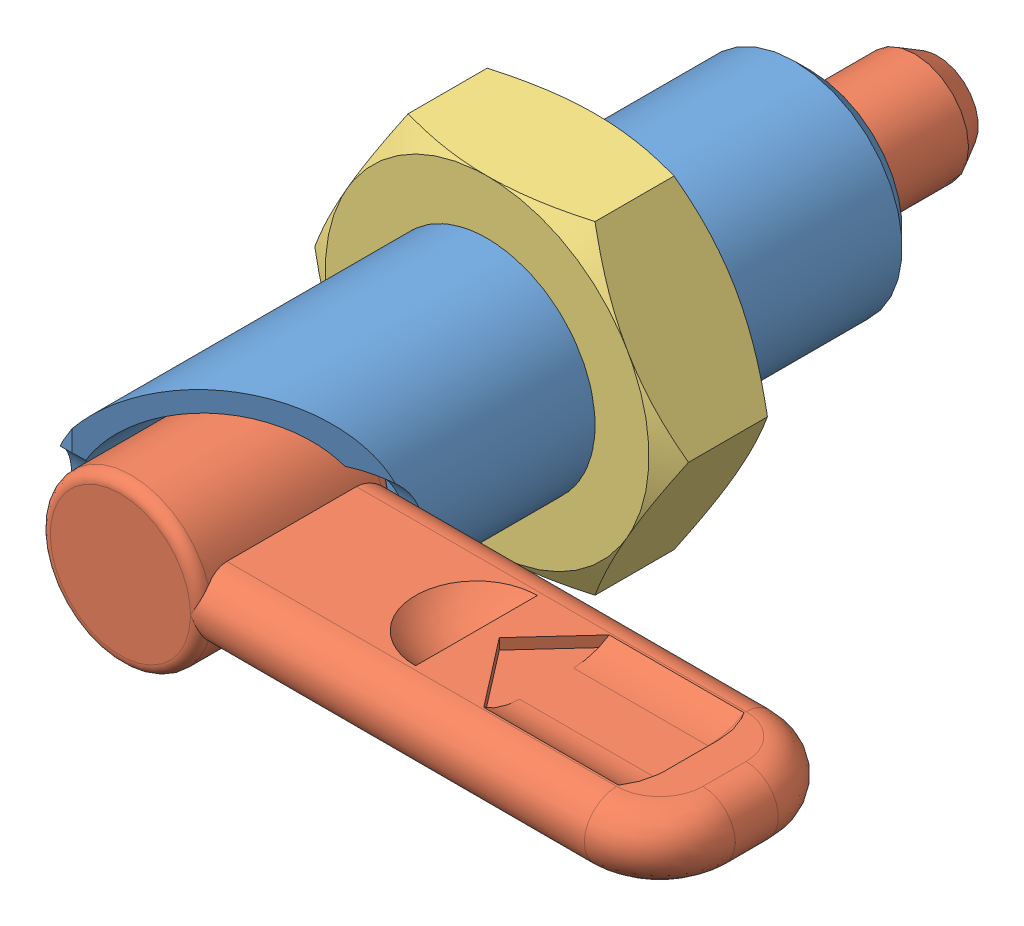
SolidWorks assembly GDX16LW-8N.sldasm, configuration Default (file format 15000). Lengths in mm.
Overall size (56.4 32.79 61.21).
3 component instances, 3 part files, 0 mates.
Components (placement in the parent):
- GDX16LW-8N_01-1: GDX16LW-8N_01.SLDPRT [ﾃﾞﾌｫﾙﾄ] x (1 0 0) z (0 -1 0) size (16.02 50.53 16.01)
- GDX16LW-8N_02-1: GDX16LW-8N_02.SLDPRT [ﾃﾞﾌｫﾙﾄ] x (1 0 0) z (0 -1 0) size (46 61.21 12)
- GDX16LW-8N_03-1: GDX16LW-8N_03.SLDPRT [ﾃﾞﾌｫﾙﾄ] at (0 0 16) x (0 0 1) z (0 1 0) size (8.01 32.79 32.79)
